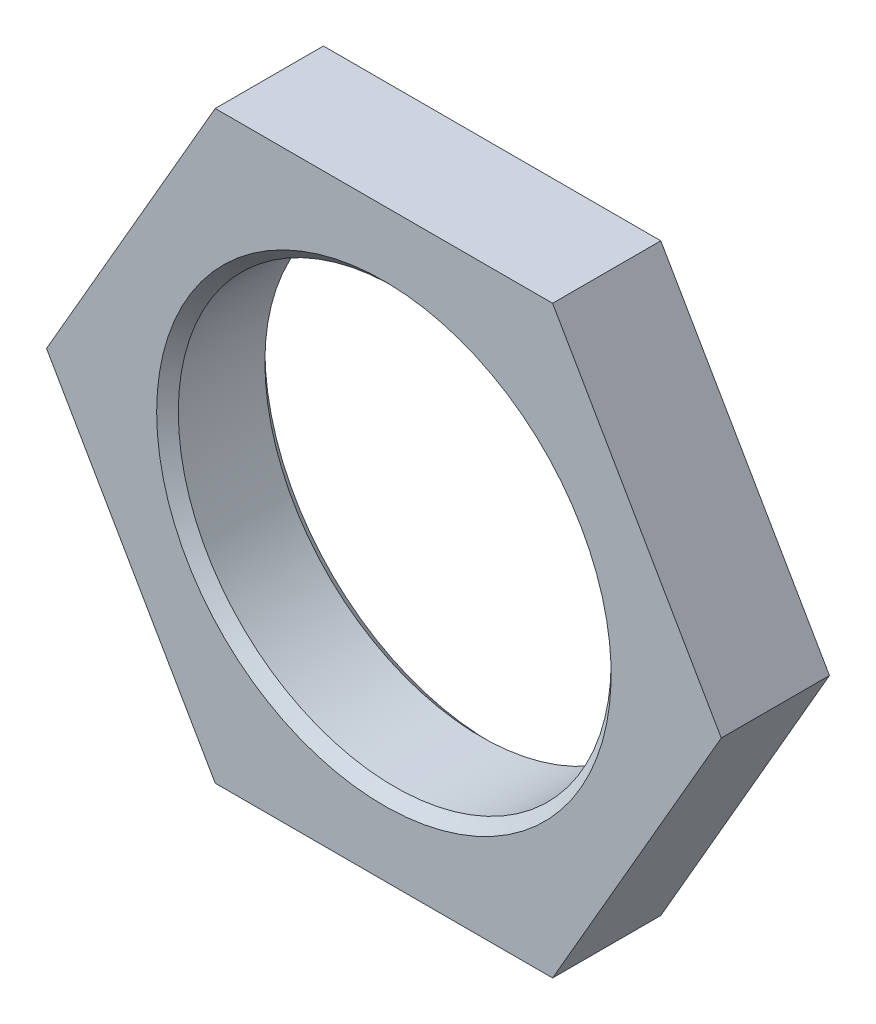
ISO-10303-21;
HEADER;
FILE_DESCRIPTION(('STEP AP214'),'2;1');
FILE_NAME('part.step','',(''),(''),'','','');
FILE_SCHEMA(('AUTOMOTIVE_DESIGN { 1 0 10303 214 1 1 1 1 }'));
ENDSEC;
DATA;
#1=APPLICATION_CONTEXT('core data for automotive mechanical design processes');
#2=APPLICATION_PROTOCOL_DEFINITION('international standard','automotive_design',2000,#1);
#3=PRODUCT_CONTEXT('',#1,'mechanical');
#4=PRODUCT('Part','Part','',(#3));
#5=PRODUCT_RELATED_PRODUCT_CATEGORY('part','',(#4));
#6=PRODUCT_DEFINITION_FORMATION('','',#4);
#7=PRODUCT_DEFINITION_CONTEXT('part definition',#1,'design');
#8=PRODUCT_DEFINITION('design','',#6,#7);
#9=PRODUCT_DEFINITION_SHAPE('','',#8);
#10=(LENGTH_UNIT() NAMED_UNIT(*) SI_UNIT(.MILLI.,.METRE.));
#11=(NAMED_UNIT(*) PLANE_ANGLE_UNIT() SI_UNIT($,.RADIAN.));
#12=(NAMED_UNIT(*) SI_UNIT($,.STERADIAN.) SOLID_ANGLE_UNIT());
#13=UNCERTAINTY_MEASURE_WITH_UNIT(LENGTH_MEASURE(1.E-05),#10,'distance_accuracy_value','');
#14=(GEOMETRIC_REPRESENTATION_CONTEXT(3) GLOBAL_UNCERTAINTY_ASSIGNED_CONTEXT((#13)) GLOBAL_UNIT_ASSIGNED_CONTEXT((#10,
#11,#12)) REPRESENTATION_CONTEXT('',''));
#15=CARTESIAN_POINT('',(0.,0.,0.));
#16=DIRECTION('',(0.,0.,1.));
#17=DIRECTION('',(1.,0.,0.));
#18=AXIS2_PLACEMENT_3D('',#15,#16,#17);
#19=CARTESIAN_POINT('',(3.11769145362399,0.,1.));
#20=DIRECTION('',(-0.866025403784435,0.500000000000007,0.));
#21=DIRECTION('',(-0.500000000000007,-0.866025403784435,0.));
#22=AXIS2_PLACEMENT_3D('',#19,#20,#21);
#23=PLANE('',#22);
#24=DIRECTION('',(0.500000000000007,0.866025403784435,0.));
#25=VECTOR('',#24,1.);
#26=CARTESIAN_POINT('',(3.11769145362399,0.,0.));
#27=LINE('',#26,#25);
#28=CARTESIAN_POINT('',(1.55884572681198,-2.69999999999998,0.));
#29=VERTEX_POINT('',#28);
#30=CARTESIAN_POINT('',(3.11769145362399,0.,0.));
#31=VERTEX_POINT('',#30);
#32=EDGE_CURVE('E116',#29,#31,#27,.T.);
#33=ORIENTED_EDGE('',*,*,#32,.T.);
#34=DIRECTION('',(0.,0.,-1.));
#35=VECTOR('',#34,1.);
#36=CARTESIAN_POINT('',(3.11769145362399,0.,1.));
#37=LINE('',#36,#35);
#38=CARTESIAN_POINT('',(3.11769145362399,0.,1.));
#39=VERTEX_POINT('',#38);
#40=EDGE_CURVE('E133',#39,#31,#37,.T.);
#41=ORIENTED_EDGE('',*,*,#40,.F.);
#42=DIRECTION('',(0.500000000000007,0.866025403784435,0.));
#43=VECTOR('',#42,1.);
#44=CARTESIAN_POINT('',(3.11769145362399,0.,1.));
#45=LINE('',#44,#43);
#46=CARTESIAN_POINT('',(1.55884572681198,-2.69999999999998,1.));
#47=VERTEX_POINT('',#46);
#48=EDGE_CURVE('E126',#47,#39,#45,.T.);
#49=ORIENTED_EDGE('',*,*,#48,.F.);
#50=DIRECTION('',(0.,0.,-1.));
#51=VECTOR('',#50,1.);
#52=CARTESIAN_POINT('',(1.55884572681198,-2.69999999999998,1.));
#53=LINE('',#52,#51);
#54=EDGE_CURVE('E112',#47,#29,#53,.T.);
#55=ORIENTED_EDGE('',*,*,#54,.T.);
#56=EDGE_LOOP('',(#33,#41,#49,#55));
#57=FACE_BOUND('',#56,.T.);
#58=ADVANCED_FACE('F30',(#57),#23,.F.);
#59=CARTESIAN_POINT('',(3.11769145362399,0.,1.));
#60=DIRECTION('',(-0.866025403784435,-0.500000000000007,0.));
#61=DIRECTION('',(0.500000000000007,-0.866025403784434,0.));
#62=AXIS2_PLACEMENT_3D('',#59,#60,#61);
#63=PLANE('',#62);
#64=DIRECTION('',(-0.500000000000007,0.866025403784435,0.));
#65=VECTOR('',#64,1.);
#66=CARTESIAN_POINT('',(3.11769145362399,0.,0.));
#67=LINE('',#66,#65);
#68=CARTESIAN_POINT('',(1.55884572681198,2.69999999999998,0.));
#69=VERTEX_POINT('',#68);
#70=EDGE_CURVE('E119',#31,#69,#67,.T.);
#71=ORIENTED_EDGE('',*,*,#70,.T.);
#72=DIRECTION('',(0.,0.,-1.));
#73=VECTOR('',#72,1.);
#74=CARTESIAN_POINT('',(1.55884572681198,2.69999999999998,1.));
#75=LINE('',#74,#73);
#76=CARTESIAN_POINT('',(1.55884572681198,2.69999999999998,1.));
#77=VERTEX_POINT('',#76);
#78=EDGE_CURVE('E130',#77,#69,#75,.T.);
#79=ORIENTED_EDGE('',*,*,#78,.F.);
#80=DIRECTION('',(-0.500000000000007,0.866025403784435,0.));
#81=VECTOR('',#80,1.);
#82=CARTESIAN_POINT('',(3.11769145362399,0.,1.));
#83=LINE('',#82,#81);
#84=EDGE_CURVE('E85',#39,#77,#83,.T.);
#85=ORIENTED_EDGE('',*,*,#84,.F.);
#86=ORIENTED_EDGE('',*,*,#40,.T.);
#87=EDGE_LOOP('',(#71,#79,#85,#86));
#88=FACE_BOUND('',#87,.T.);
#89=ADVANCED_FACE('F178',(#88),#63,.F.);
#90=CARTESIAN_POINT('',(-1.55884572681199,2.69999999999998,1.));
#91=DIRECTION('',(0.,-1.,0.));
#92=DIRECTION('',(0.,0.,-1.));
#93=AXIS2_PLACEMENT_3D('',#90,#91,#92);
#94=PLANE('',#93);
#95=DIRECTION('',(-1.,0.,0.));
#96=VECTOR('',#95,1.);
#97=CARTESIAN_POINT('',(-1.55884572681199,2.69999999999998,0.));
#98=LINE('',#97,#96);
#99=CARTESIAN_POINT('',(-1.55884572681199,2.69999999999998,0.));
#100=VERTEX_POINT('',#99);
#101=EDGE_CURVE('E121',#69,#100,#98,.T.);
#102=ORIENTED_EDGE('',*,*,#101,.T.);
#103=DIRECTION('',(0.,0.,-1.));
#104=VECTOR('',#103,1.);
#105=CARTESIAN_POINT('',(-1.55884572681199,2.69999999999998,1.));
#106=LINE('',#105,#104);
#107=CARTESIAN_POINT('',(-1.55884572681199,2.69999999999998,1.));
#108=VERTEX_POINT('',#107);
#109=EDGE_CURVE('E107',#108,#100,#106,.T.);
#110=ORIENTED_EDGE('',*,*,#109,.F.);
#111=DIRECTION('',(-1.,0.,0.));
#112=VECTOR('',#111,1.);
#113=CARTESIAN_POINT('',(-1.55884572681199,2.69999999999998,1.));
#114=LINE('',#113,#112);
#115=EDGE_CURVE('E98',#77,#108,#114,.T.);
#116=ORIENTED_EDGE('',*,*,#115,.F.);
#117=ORIENTED_EDGE('',*,*,#78,.T.);
#118=EDGE_LOOP('',(#102,#110,#116,#117));
#119=FACE_BOUND('',#118,.T.);
#120=ADVANCED_FACE('F183',(#119),#94,.F.);
#121=CARTESIAN_POINT('',(-3.117691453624,0.,1.));
#122=DIRECTION('',(0.866025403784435,-0.500000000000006,0.));
#123=DIRECTION('',(0.500000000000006,0.866025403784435,0.));
#124=AXIS2_PLACEMENT_3D('',#121,#122,#123);
#125=PLANE('',#124);
#126=DIRECTION('',(-0.500000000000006,-0.866025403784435,0.));
#127=VECTOR('',#126,1.);
#128=CARTESIAN_POINT('',(-3.117691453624,0.,0.));
#129=LINE('',#128,#127);
#130=CARTESIAN_POINT('',(-3.117691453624,0.,0.));
#131=VERTEX_POINT('',#130);
#132=EDGE_CURVE('E106',#100,#131,#129,.T.);
#133=ORIENTED_EDGE('',*,*,#132,.T.);
#134=DIRECTION('',(0.,0.,-1.));
#135=VECTOR('',#134,1.);
#136=CARTESIAN_POINT('',(-3.117691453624,0.,1.));
#137=LINE('',#136,#135);
#138=CARTESIAN_POINT('',(-3.117691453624,0.,1.));
#139=VERTEX_POINT('',#138);
#140=EDGE_CURVE('E103',#139,#131,#137,.T.);
#141=ORIENTED_EDGE('',*,*,#140,.F.);
#142=DIRECTION('',(-0.500000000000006,-0.866025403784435,0.));
#143=VECTOR('',#142,1.);
#144=CARTESIAN_POINT('',(-3.117691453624,0.,1.));
#145=LINE('',#144,#143);
#146=EDGE_CURVE('E92',#108,#139,#145,.T.);
#147=ORIENTED_EDGE('',*,*,#146,.F.);
#148=ORIENTED_EDGE('',*,*,#109,.T.);
#149=EDGE_LOOP('',(#133,#141,#147,#148));
#150=FACE_BOUND('',#149,.T.);
#151=ADVANCED_FACE('F104',(#150),#125,.F.);
#152=CARTESIAN_POINT('',(-3.117691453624,0.,1.));
#153=DIRECTION('',(0.866025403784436,0.500000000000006,0.));
#154=DIRECTION('',(-0.500000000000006,0.866025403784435,0.));
#155=AXIS2_PLACEMENT_3D('',#152,#153,#154);
#156=PLANE('',#155);
#157=DIRECTION('',(0.500000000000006,-0.866025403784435,0.));
#158=VECTOR('',#157,1.);
#159=CARTESIAN_POINT('',(-3.117691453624,0.,0.));
#160=LINE('',#159,#158);
#161=CARTESIAN_POINT('',(-1.55884572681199,-2.69999999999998,0.));
#162=VERTEX_POINT('',#161);
#163=EDGE_CURVE('E70',#131,#162,#160,.T.);
#164=ORIENTED_EDGE('',*,*,#163,.T.);
#165=DIRECTION('',(0.,0.,-1.));
#166=VECTOR('',#165,1.);
#167=CARTESIAN_POINT('',(-1.55884572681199,-2.69999999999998,1.));
#168=LINE('',#167,#166);
#169=CARTESIAN_POINT('',(-1.55884572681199,-2.69999999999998,1.));
#170=VERTEX_POINT('',#169);
#171=EDGE_CURVE('E108',#170,#162,#168,.T.);
#172=ORIENTED_EDGE('',*,*,#171,.F.);
#173=DIRECTION('',(0.500000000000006,-0.866025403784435,0.));
#174=VECTOR('',#173,1.);
#175=CARTESIAN_POINT('',(-3.117691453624,0.,1.));
#176=LINE('',#175,#174);
#177=EDGE_CURVE('E96',#139,#170,#176,.T.);
#178=ORIENTED_EDGE('',*,*,#177,.F.);
#179=ORIENTED_EDGE('',*,*,#140,.T.);
#180=EDGE_LOOP('',(#164,#172,#178,#179));
#181=FACE_BOUND('',#180,.T.);
#182=ADVANCED_FACE('F110',(#181),#156,.F.);
#183=CARTESIAN_POINT('',(-1.55884572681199,-2.69999999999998,1.));
#184=DIRECTION('',(0.,1.,0.));
#185=DIRECTION('',(0.,0.,1.));
#186=AXIS2_PLACEMENT_3D('',#183,#184,#185);
#187=PLANE('',#186);
#188=DIRECTION('',(1.,0.,0.));
#189=VECTOR('',#188,1.);
#190=CARTESIAN_POINT('',(-1.55884572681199,-2.69999999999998,0.));
#191=LINE('',#190,#189);
#192=EDGE_CURVE('E76',#162,#29,#191,.T.);
#193=ORIENTED_EDGE('',*,*,#192,.T.);
#194=ORIENTED_EDGE('',*,*,#54,.F.);
#195=DIRECTION('',(1.,0.,0.));
#196=VECTOR('',#195,1.);
#197=CARTESIAN_POINT('',(-1.55884572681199,-2.69999999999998,1.));
#198=LINE('',#197,#196);
#199=EDGE_CURVE('E47',#170,#47,#198,.T.);
#200=ORIENTED_EDGE('',*,*,#199,.F.);
#201=ORIENTED_EDGE('',*,*,#171,.T.);
#202=EDGE_LOOP('',(#193,#194,#200,#201));
#203=FACE_BOUND('',#202,.T.);
#204=ADVANCED_FACE('F168',(#203),#187,.F.);
#205=CARTESIAN_POINT('',(3.11769145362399,0.,1.));
#206=DIRECTION('',(0.,0.,-1.));
#207=DIRECTION('',(-1.,0.,0.));
#208=AXIS2_PLACEMENT_3D('',#205,#206,#207);
#209=PLANE('',#208);
#210=CARTESIAN_POINT('',(0.,0.,1.));
#211=DIRECTION('',(0.,0.,-1.));
#212=DIRECTION('',(-1.,0.,0.));
#213=AXIS2_PLACEMENT_3D('',#210,#211,#212);
#214=CIRCLE('',#213,2.1);
#215=CARTESIAN_POINT('',(-2.1,0.,1.));
#216=VERTEX_POINT('',#215);
#217=EDGE_CURVE('E39',#216,#216,#214,.T.);
#218=ORIENTED_EDGE('',*,*,#217,.T.);
#219=EDGE_LOOP('',(#218));
#220=FACE_BOUND('',#219,.T.);
#221=ORIENTED_EDGE('',*,*,#48,.T.);
#222=ORIENTED_EDGE('',*,*,#84,.T.);
#223=ORIENTED_EDGE('',*,*,#115,.T.);
#224=ORIENTED_EDGE('',*,*,#146,.T.);
#225=ORIENTED_EDGE('',*,*,#177,.T.);
#226=ORIENTED_EDGE('',*,*,#199,.T.);
#227=EDGE_LOOP('',(#221,#222,#223,#224,#225,#226));
#228=FACE_BOUND('',#227,.T.);
#229=ADVANCED_FACE('F94',(#220,#228),#209,.F.);
#230=CARTESIAN_POINT('',(3.11769145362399,0.,0.));
#231=DIRECTION('',(0.,0.,-1.));
#232=DIRECTION('',(-1.,0.,0.));
#233=AXIS2_PLACEMENT_3D('',#230,#231,#232);
#234=PLANE('',#233);
#235=CARTESIAN_POINT('',(0.,0.,0.));
#236=DIRECTION('',(0.,0.,-1.));
#237=DIRECTION('',(-1.,0.,0.));
#238=AXIS2_PLACEMENT_3D('',#235,#236,#237);
#239=CIRCLE('',#238,2.1);
#240=CARTESIAN_POINT('',(-2.1,0.,0.));
#241=VERTEX_POINT('',#240);
#242=EDGE_CURVE('E11',#241,#241,#239,.F.);
#243=ORIENTED_EDGE('',*,*,#242,.T.);
#244=EDGE_LOOP('',(#243));
#245=FACE_BOUND('',#244,.T.);
#246=ORIENTED_EDGE('',*,*,#32,.F.);
#247=ORIENTED_EDGE('',*,*,#192,.F.);
#248=ORIENTED_EDGE('',*,*,#163,.F.);
#249=ORIENTED_EDGE('',*,*,#132,.F.);
#250=ORIENTED_EDGE('',*,*,#101,.F.);
#251=ORIENTED_EDGE('',*,*,#70,.F.);
#252=EDGE_LOOP('',(#246,#247,#248,#249,#250,#251));
#253=FACE_BOUND('',#252,.T.);
#254=ADVANCED_FACE('F152',(#245,#253),#234,.T.);
#255=CARTESIAN_POINT('',(0.,0.,0.));
#256=DIRECTION('',(0.,0.,1.));
#257=DIRECTION('',(1.,0.,0.));
#258=AXIS2_PLACEMENT_3D('',#255,#256,#257);
#259=CYLINDRICAL_SURFACE('',#258,2.);
#260=CARTESIAN_POINT('',(0.,0.,0.899999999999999));
#261=DIRECTION('',(0.,0.,-1.));
#262=DIRECTION('',(-1.,0.,0.));
#263=AXIS2_PLACEMENT_3D('',#260,#261,#262);
#264=CIRCLE('',#263,2.);
#265=CARTESIAN_POINT('',(-2.,0.,0.899999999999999));
#266=VERTEX_POINT('',#265);
#267=EDGE_CURVE('E138',#266,#266,#264,.F.);
#268=ORIENTED_EDGE('',*,*,#267,.T.);
#269=EDGE_LOOP('',(#268));
#270=FACE_BOUND('',#269,.T.);
#271=CARTESIAN_POINT('',(0.,0.,0.100000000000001));
#272=DIRECTION('',(0.,0.,-1.));
#273=DIRECTION('',(-1.,0.,0.));
#274=AXIS2_PLACEMENT_3D('',#271,#272,#273);
#275=CIRCLE('',#274,2.);
#276=CARTESIAN_POINT('',(-2.,0.,0.100000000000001));
#277=VERTEX_POINT('',#276);
#278=EDGE_CURVE('E135',#277,#277,#275,.T.);
#279=ORIENTED_EDGE('',*,*,#278,.T.);
#280=EDGE_LOOP('',(#279));
#281=FACE_BOUND('',#280,.T.);
#282=ADVANCED_FACE('F147',(#270,#281),#259,.F.);
#283=CARTESIAN_POINT('',(0.,0.,0.899999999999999));
#284=DIRECTION('',(0.,0.,1.));
#285=DIRECTION('',(1.,0.,0.));
#286=AXIS2_PLACEMENT_3D('',#283,#284,#285);
#287=CONICAL_SURFACE('',#286,2.,0.785398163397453);
#288=ORIENTED_EDGE('',*,*,#217,.F.);
#289=EDGE_LOOP('',(#288));
#290=FACE_BOUND('',#289,.T.);
#291=ORIENTED_EDGE('',*,*,#267,.F.);
#292=EDGE_LOOP('',(#291));
#293=FACE_BOUND('',#292,.T.);
#294=ADVANCED_FACE('F144',(#290,#293),#287,.F.);
#295=CARTESIAN_POINT('',(0.,0.,0.));
#296=DIRECTION('',(0.,0.,-1.));
#297=DIRECTION('',(-1.,0.,0.));
#298=AXIS2_PLACEMENT_3D('',#295,#296,#297);
#299=CONICAL_SURFACE('',#298,2.1,0.785398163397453);
#300=ORIENTED_EDGE('',*,*,#278,.F.);
#301=EDGE_LOOP('',(#300));
#302=FACE_BOUND('',#301,.T.);
#303=ORIENTED_EDGE('',*,*,#242,.F.);
#304=EDGE_LOOP('',(#303));
#305=FACE_BOUND('',#304,.T.);
#306=ADVANCED_FACE('F32',(#302,#305),#299,.F.);
#307=CLOSED_SHELL('',(#58,#89,#120,#151,#182,#204,#229,#254,#282,#294,#306));
#308=MANIFOLD_SOLID_BREP('B2',#307);
#309=ADVANCED_BREP_SHAPE_REPRESENTATION('',(#18,#308),#14);
#310=SHAPE_DEFINITION_REPRESENTATION(#9,#309);
ENDSEC;
END-ISO-10303-21;
